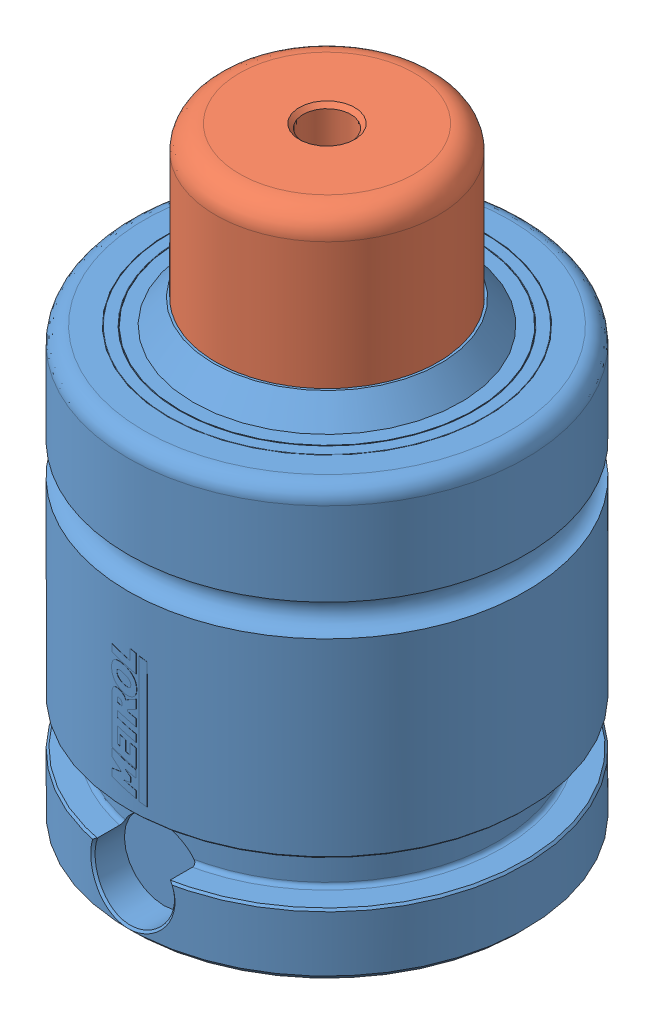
SolidWorks assembly EX1000-019.SLDASM, configuration Default (file format 7000). Lengths in mm.
Overall size (50 76 50.1).
2 component instances, 2 part files, 5 mates.
Components (placement in the parent):
- EX-1000 Body-1: EX-1000 Body.SLDPRT [EX-1000-019] x (0 0 1) z (0 -1 0) size (50.1 50 57)
- EX-1000 Piston-1: EX-1000 Piston.SLDPRT [EX-1000-019] at (0 39 0) x (-0.174764 0 0.98461) z (0 -1 0) size (40 40 37)
Mates (geometry in assembly coordinates):
- Concentric1: concentric aligned: cylinder of EX-1000 Body-1 through (0 0 0) axis (0 -1 0) radius 14; cylinder of EX-1000 Piston-1 through (0 39 0) axis (0 -1 0) radius 14
- LimitDistance1: limit distance anti-aligned: plane of EX-1000 Piston-1 through (-19.6922 44 -3.4953) normal (0 1 0); plane of EX-1000 Body-1 through (-14 44 0) normal (0 -1 0)
- Coincident1: coincident anti-aligned: plane of EX-1000 Body-1 through (0 0 0) normal (0 -1 0); plane of assembly through (0 0 0) normal (0 1 0)
- Coincident2: coincident aligned: plane of EX-1000 Body-1; plane of assembly through (0 0 0) normal (0 0 1)
- Coincident3: coincident anti-aligned: plane of EX-1000 Body-1; plane of assembly through (0 0 0) normal (1 0 0)
